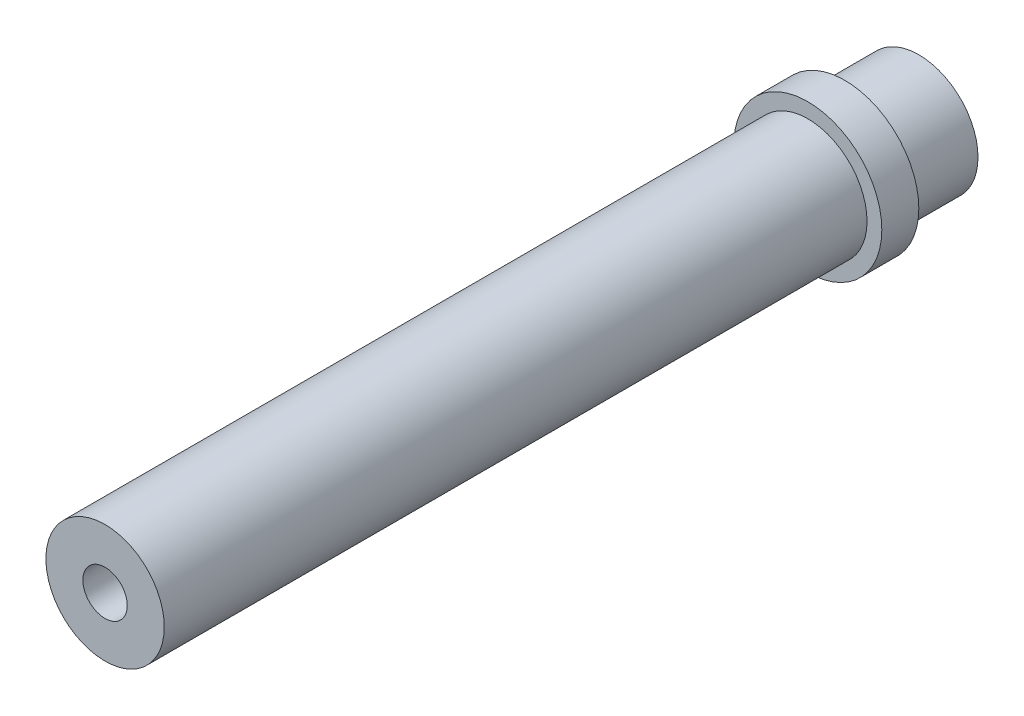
from build123d import *

# Parameters (mm, degrees)
SKETCH_1_R          = 8
EXTRUDE_1_DEPTH     = 110
SKETCH_2_R          = 10
EXTRUDE_2_DEPTH     = 5
SKETCH_3_R          = 3
CUT_EXTRUDE_1_DEPTH = 15
CUT_EXTRUDE_START   = -15
SKETCH_4_R          = 3
CUT_EXTRUDE_2_DEPTH = 15


with BuildPart() as part:
    # Sketch 1 → Extrude 1 (new body)
    with BuildSketch(Plane.XY):
        Circle(SKETCH_1_R)
    extrude(amount=EXTRUDE_1_DEPTH)

    # Sketch 2 → Extrude 2 (add)
    with BuildSketch(Plane.XY.offset(10)):
        Circle(SKETCH_2_R)
    extrude(amount=EXTRUDE_2_DEPTH)

    # Sketch 3 → Cut-Extrude 1 (cut)
    with BuildSketch(Plane(origin=(0, 0, 0), x_dir=(-1, 0, 0), z_dir=(0, 0, -1))):
        Circle(SKETCH_3_R)
    extrude(amount=-CUT_EXTRUDE_1_DEPTH, mode=Mode.SUBTRACT)

    # Sketch 4 → Cut-Extrude 2 (cut)
    with BuildSketch(Plane.XY.offset(110).offset(CUT_EXTRUDE_START)):
        with Locations(Location((0, 0, 0), (0, 0, 180))):
            Circle(SKETCH_4_R)
    extrude(amount=CUT_EXTRUDE_2_DEPTH, mode=Mode.SUBTRACT)


solid = part.part
